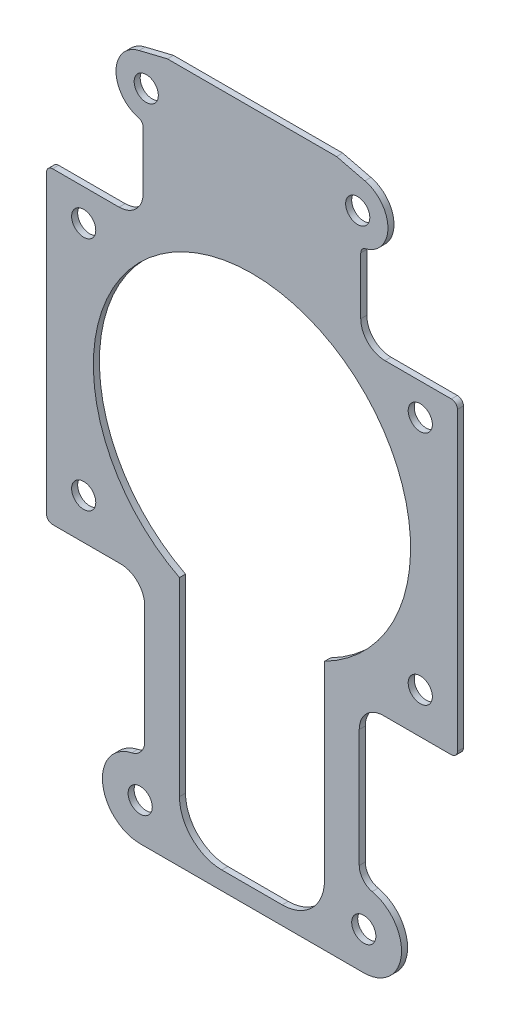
ISO-10303-21;
HEADER;
FILE_DESCRIPTION(('STEP AP214'),'2;1');
FILE_NAME('part.step','',(''),(''),'','','');
FILE_SCHEMA(('AUTOMOTIVE_DESIGN { 1 0 10303 214 1 1 1 1 }'));
ENDSEC;
DATA;
#1=APPLICATION_CONTEXT('core data for automotive mechanical design processes');
#2=APPLICATION_PROTOCOL_DEFINITION('international standard','automotive_design',2000,#1);
#3=PRODUCT_CONTEXT('',#1,'mechanical');
#4=PRODUCT('Part','Part','',(#3));
#5=PRODUCT_RELATED_PRODUCT_CATEGORY('part','',(#4));
#6=PRODUCT_DEFINITION_FORMATION('','',#4);
#7=PRODUCT_DEFINITION_CONTEXT('part definition',#1,'design');
#8=PRODUCT_DEFINITION('design','',#6,#7);
#9=PRODUCT_DEFINITION_SHAPE('','',#8);
#10=(LENGTH_UNIT() NAMED_UNIT(*) SI_UNIT(.MILLI.,.METRE.));
#11=(NAMED_UNIT(*) PLANE_ANGLE_UNIT() SI_UNIT($,.RADIAN.));
#12=(NAMED_UNIT(*) SI_UNIT($,.STERADIAN.) SOLID_ANGLE_UNIT());
#13=UNCERTAINTY_MEASURE_WITH_UNIT(LENGTH_MEASURE(1.E-05),#10,'distance_accuracy_value','');
#14=(GEOMETRIC_REPRESENTATION_CONTEXT(3) GLOBAL_UNCERTAINTY_ASSIGNED_CONTEXT((#13)) GLOBAL_UNIT_ASSIGNED_CONTEXT((#10,
#11,#12)) REPRESENTATION_CONTEXT('',''));
#15=CARTESIAN_POINT('',(0.,0.,0.));
#16=DIRECTION('',(0.,0.,1.));
#17=DIRECTION('',(1.,0.,0.));
#18=AXIS2_PLACEMENT_3D('',#15,#16,#17);
#19=CARTESIAN_POINT('',(-17.5,108.,1.));
#20=DIRECTION('',(0.,0.,1.));
#21=DIRECTION('',(1.,0.,0.));
#22=AXIS2_PLACEMENT_3D('',#19,#20,#21);
#23=PLANE('',#22);
#24=CARTESIAN_POINT('',(-17.5,108.,1.));
#25=DIRECTION('',(0.,0.,1.));
#26=DIRECTION('',(1.,0.,0.));
#27=AXIS2_PLACEMENT_3D('',#24,#25,#26);
#28=CIRCLE('',#27,2.);
#29=CARTESIAN_POINT('',(-15.5,108.,1.));
#30=VERTEX_POINT('',#29);
#31=EDGE_CURVE('E1080',#30,#30,#28,.T.);
#32=ORIENTED_EDGE('',*,*,#31,.F.);
#33=EDGE_LOOP('',(#32));
#34=FACE_BOUND('',#33,.T.);
#35=CARTESIAN_POINT('',(-27.8511695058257,83.5015988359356,1.));
#36=DIRECTION('',(0.,0.,1.));
#37=DIRECTION('',(1.,0.,0.));
#38=AXIS2_PLACEMENT_3D('',#35,#36,#37);
#39=CIRCLE('',#38,2.);
#40=CARTESIAN_POINT('',(-25.8511695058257,83.5015988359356,1.));
#41=VERTEX_POINT('',#40);
#42=EDGE_CURVE('E1092',#41,#41,#39,.T.);
#43=ORIENTED_EDGE('',*,*,#42,.F.);
#44=EDGE_LOOP('',(#43));
#45=FACE_BOUND('',#44,.T.);
#46=CARTESIAN_POINT('',(-27.8511695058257,44.4984011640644,1.));
#47=DIRECTION('',(0.,0.,1.));
#48=DIRECTION('',(1.,0.,0.));
#49=AXIS2_PLACEMENT_3D('',#46,#47,#48);
#50=CIRCLE('',#49,2.);
#51=CARTESIAN_POINT('',(-25.8511695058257,44.4984011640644,1.));
#52=VERTEX_POINT('',#51);
#53=EDGE_CURVE('E1104',#52,#52,#50,.T.);
#54=ORIENTED_EDGE('',*,*,#53,.F.);
#55=EDGE_LOOP('',(#54));
#56=FACE_BOUND('',#55,.T.);
#57=CARTESIAN_POINT('',(-18.5,5.49999999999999,1.));
#58=DIRECTION('',(0.,0.,1.));
#59=DIRECTION('',(1.,0.,0.));
#60=AXIS2_PLACEMENT_3D('',#57,#58,#59);
#61=CIRCLE('',#60,2.);
#62=CARTESIAN_POINT('',(-16.5,5.49999999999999,1.));
#63=VERTEX_POINT('',#62);
#64=EDGE_CURVE('E285',#63,#63,#61,.T.);
#65=ORIENTED_EDGE('',*,*,#64,.F.);
#66=EDGE_LOOP('',(#65));
#67=FACE_BOUND('',#66,.T.);
#68=CARTESIAN_POINT('',(-17.5,108.,1.));
#69=DIRECTION('',(0.,0.,1.));
#70=DIRECTION('',(1.,0.,0.));
#71=AXIS2_PLACEMENT_3D('',#68,#69,#70);
#72=CIRCLE('',#71,4.99999999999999);
#73=CARTESIAN_POINT('',(-18.6845546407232,112.857656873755,1.));
#74=VERTEX_POINT('',#73);
#75=CARTESIAN_POINT('',(-18.7500000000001,103.158770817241,1.));
#76=VERTEX_POINT('',#75);
#77=EDGE_CURVE('E378',#74,#76,#72,.T.);
#78=ORIENTED_EDGE('',*,*,#77,.T.);
#79=CARTESIAN_POINT('',(-19.0000000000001,102.190524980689,1.));
#80=DIRECTION('',(0.,0.,-1.));
#81=DIRECTION('',(1.,0.,0.));
#82=AXIS2_PLACEMENT_3D('',#79,#80,#81);
#83=CIRCLE('',#82,1.00000000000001);
#84=CARTESIAN_POINT('',(-18.,102.190524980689,1.));
#85=VERTEX_POINT('',#84);
#86=EDGE_CURVE('E381',#76,#85,#83,.T.);
#87=ORIENTED_EDGE('',*,*,#86,.T.);
#88=DIRECTION('',(0.,-1.,0.));
#89=VECTOR('',#88,1.);
#90=CARTESIAN_POINT('',(-18.,102.190524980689,1.));
#91=LINE('',#90,#89);
#92=CARTESIAN_POINT('',(-18.,92.75,1.));
#93=VERTEX_POINT('',#92);
#94=EDGE_CURVE('E383',#85,#93,#91,.T.);
#95=ORIENTED_EDGE('',*,*,#94,.T.);
#96=CARTESIAN_POINT('',(-22.,92.75,1.));
#97=DIRECTION('',(0.,0.,-1.));
#98=DIRECTION('',(1.,0.,0.));
#99=AXIS2_PLACEMENT_3D('',#96,#97,#98);
#100=CIRCLE('',#99,4.00000000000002);
#101=CARTESIAN_POINT('',(-22.,88.75,1.));
#102=VERTEX_POINT('',#101);
#103=EDGE_CURVE('E385',#93,#102,#100,.T.);
#104=ORIENTED_EDGE('',*,*,#103,.T.);
#105=DIRECTION('',(-1.,0.,0.));
#106=VECTOR('',#105,1.);
#107=CARTESIAN_POINT('',(-22.,88.75,1.));
#108=LINE('',#107,#106);
#109=CARTESIAN_POINT('',(-33.,88.75,1.));
#110=VERTEX_POINT('',#109);
#111=EDGE_CURVE('E387',#102,#110,#108,.T.);
#112=ORIENTED_EDGE('',*,*,#111,.T.);
#113=CARTESIAN_POINT('',(-33.,87.75,1.));
#114=DIRECTION('',(0.,0.,1.));
#115=DIRECTION('',(1.,0.,0.));
#116=AXIS2_PLACEMENT_3D('',#113,#114,#115);
#117=CIRCLE('',#116,1.);
#118=CARTESIAN_POINT('',(-34.,87.75,1.));
#119=VERTEX_POINT('',#118);
#120=EDGE_CURVE('E389',#110,#119,#117,.T.);
#121=ORIENTED_EDGE('',*,*,#120,.T.);
#122=DIRECTION('',(0.,-1.,0.));
#123=VECTOR('',#122,1.);
#124=CARTESIAN_POINT('',(-34.,87.75,1.));
#125=LINE('',#124,#123);
#126=CARTESIAN_POINT('',(-34.,38.75,1.));
#127=VERTEX_POINT('',#126);
#128=EDGE_CURVE('E391',#119,#127,#125,.T.);
#129=ORIENTED_EDGE('',*,*,#128,.T.);
#130=CARTESIAN_POINT('',(-33.,38.75,1.));
#131=DIRECTION('',(0.,0.,1.));
#132=DIRECTION('',(1.,0.,0.));
#133=AXIS2_PLACEMENT_3D('',#130,#131,#132);
#134=CIRCLE('',#133,0.999999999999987);
#135=CARTESIAN_POINT('',(-33.,37.75,1.));
#136=VERTEX_POINT('',#135);
#137=EDGE_CURVE('E393',#127,#136,#134,.T.);
#138=ORIENTED_EDGE('',*,*,#137,.T.);
#139=DIRECTION('',(1.,0.,0.));
#140=VECTOR('',#139,1.);
#141=CARTESIAN_POINT('',(-33.,37.75,1.));
#142=LINE('',#141,#140);
#143=CARTESIAN_POINT('',(-21.75,37.75,1.));
#144=VERTEX_POINT('',#143);
#145=EDGE_CURVE('E395',#136,#144,#142,.T.);
#146=ORIENTED_EDGE('',*,*,#145,.T.);
#147=CARTESIAN_POINT('',(-21.75,33.75,1.));
#148=DIRECTION('',(0.,0.,-1.));
#149=DIRECTION('',(1.,0.,0.));
#150=AXIS2_PLACEMENT_3D('',#147,#148,#149);
#151=CIRCLE('',#150,4.);
#152=CARTESIAN_POINT('',(-17.75,33.75,1.));
#153=VERTEX_POINT('',#152);
#154=EDGE_CURVE('E397',#144,#153,#151,.T.);
#155=ORIENTED_EDGE('',*,*,#154,.T.);
#156=DIRECTION('',(0.,-1.,0.));
#157=VECTOR('',#156,1.);
#158=CARTESIAN_POINT('',(-17.75,33.75,1.));
#159=LINE('',#158,#157);
#160=CARTESIAN_POINT('',(-17.75,14.2749643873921,1.));
#161=VERTEX_POINT('',#160);
#162=EDGE_CURVE('E399',#153,#161,#159,.T.);
#163=ORIENTED_EDGE('',*,*,#162,.T.);
#164=CARTESIAN_POINT('',(-20.5,14.2749643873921,1.));
#165=DIRECTION('',(0.,0.,-1.));
#166=DIRECTION('',(1.,0.,0.));
#167=AXIS2_PLACEMENT_3D('',#164,#165,#166);
#168=CIRCLE('',#167,2.75);
#169=CARTESIAN_POINT('',(-19.8888888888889,11.5937252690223,1.));
#170=VERTEX_POINT('',#169);
#171=EDGE_CURVE('E401',#161,#170,#168,.T.);
#172=ORIENTED_EDGE('',*,*,#171,.T.);
#173=CARTESIAN_POINT('',(-18.5,5.49999999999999,1.));
#174=DIRECTION('',(0.,0.,1.));
#175=DIRECTION('',(1.,0.,0.));
#176=AXIS2_PLACEMENT_3D('',#173,#174,#175);
#177=CIRCLE('',#176,6.25);
#178=CARTESIAN_POINT('',(-18.5,-0.750000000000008,1.));
#179=VERTEX_POINT('',#178);
#180=EDGE_CURVE('E403',#170,#179,#177,.T.);
#181=ORIENTED_EDGE('',*,*,#180,.T.);
#182=DIRECTION('',(1.,0.,0.));
#183=VECTOR('',#182,1.);
#184=CARTESIAN_POINT('',(-18.5,-0.750000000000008,1.));
#185=LINE('',#184,#183);
#186=CARTESIAN_POINT('',(18.5,-0.75,1.));
#187=VERTEX_POINT('',#186);
#188=EDGE_CURVE('E405',#179,#187,#185,.T.);
#189=ORIENTED_EDGE('',*,*,#188,.T.);
#190=CARTESIAN_POINT('',(18.5,5.5,1.));
#191=DIRECTION('',(0.,0.,1.));
#192=DIRECTION('',(1.,0.,0.));
#193=AXIS2_PLACEMENT_3D('',#190,#191,#192);
#194=CIRCLE('',#193,6.25);
#195=CARTESIAN_POINT('',(19.8888888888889,11.5937252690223,1.));
#196=VERTEX_POINT('',#195);
#197=EDGE_CURVE('E407',#187,#196,#194,.T.);
#198=ORIENTED_EDGE('',*,*,#197,.T.);
#199=CARTESIAN_POINT('',(20.5,14.2749643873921,1.));
#200=DIRECTION('',(0.,0.,-1.));
#201=DIRECTION('',(1.,0.,0.));
#202=AXIS2_PLACEMENT_3D('',#199,#200,#201);
#203=CIRCLE('',#202,2.75);
#204=CARTESIAN_POINT('',(17.75,14.2749643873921,1.));
#205=VERTEX_POINT('',#204);
#206=EDGE_CURVE('E409',#196,#205,#203,.T.);
#207=ORIENTED_EDGE('',*,*,#206,.T.);
#208=DIRECTION('',(0.,1.,0.));
#209=VECTOR('',#208,1.);
#210=CARTESIAN_POINT('',(17.75,14.2749643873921,1.));
#211=LINE('',#210,#209);
#212=CARTESIAN_POINT('',(17.75,33.75,1.));
#213=VERTEX_POINT('',#212);
#214=EDGE_CURVE('E411',#205,#213,#211,.T.);
#215=ORIENTED_EDGE('',*,*,#214,.T.);
#216=CARTESIAN_POINT('',(21.75,33.75,1.));
#217=DIRECTION('',(0.,0.,-1.));
#218=DIRECTION('',(1.,0.,0.));
#219=AXIS2_PLACEMENT_3D('',#216,#217,#218);
#220=CIRCLE('',#219,4.);
#221=CARTESIAN_POINT('',(21.75,37.75,1.));
#222=VERTEX_POINT('',#221);
#223=EDGE_CURVE('E413',#213,#222,#220,.T.);
#224=ORIENTED_EDGE('',*,*,#223,.T.);
#225=DIRECTION('',(1.,0.,0.));
#226=VECTOR('',#225,1.);
#227=CARTESIAN_POINT('',(21.75,37.75,1.));
#228=LINE('',#227,#226);
#229=CARTESIAN_POINT('',(33.,37.75,1.));
#230=VERTEX_POINT('',#229);
#231=EDGE_CURVE('E415',#222,#230,#228,.T.);
#232=ORIENTED_EDGE('',*,*,#231,.T.);
#233=CARTESIAN_POINT('',(33.,38.75,1.));
#234=DIRECTION('',(0.,0.,1.));
#235=DIRECTION('',(1.,0.,0.));
#236=AXIS2_PLACEMENT_3D('',#233,#234,#235);
#237=CIRCLE('',#236,1.);
#238=CARTESIAN_POINT('',(34.,38.75,1.));
#239=VERTEX_POINT('',#238);
#240=EDGE_CURVE('E417',#230,#239,#237,.T.);
#241=ORIENTED_EDGE('',*,*,#240,.T.);
#242=DIRECTION('',(0.,1.,0.));
#243=VECTOR('',#242,1.);
#244=CARTESIAN_POINT('',(34.,38.75,1.));
#245=LINE('',#244,#243);
#246=CARTESIAN_POINT('',(34.,87.75,1.));
#247=VERTEX_POINT('',#246);
#248=EDGE_CURVE('E419',#239,#247,#245,.T.);
#249=ORIENTED_EDGE('',*,*,#248,.T.);
#250=CARTESIAN_POINT('',(33.,87.75,1.));
#251=DIRECTION('',(0.,0.,1.));
#252=DIRECTION('',(1.,0.,0.));
#253=AXIS2_PLACEMENT_3D('',#250,#251,#252);
#254=CIRCLE('',#253,0.999999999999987);
#255=CARTESIAN_POINT('',(33.,88.75,1.));
#256=VERTEX_POINT('',#255);
#257=EDGE_CURVE('E421',#247,#256,#254,.T.);
#258=ORIENTED_EDGE('',*,*,#257,.T.);
#259=DIRECTION('',(-1.,0.,0.));
#260=VECTOR('',#259,1.);
#261=CARTESIAN_POINT('',(33.,88.75,1.));
#262=LINE('',#261,#260);
#263=CARTESIAN_POINT('',(22.,88.75,1.));
#264=VERTEX_POINT('',#263);
#265=EDGE_CURVE('E423',#256,#264,#262,.T.);
#266=ORIENTED_EDGE('',*,*,#265,.T.);
#267=CARTESIAN_POINT('',(22.,92.75,1.));
#268=DIRECTION('',(0.,0.,-1.));
#269=DIRECTION('',(1.,0.,0.));
#270=AXIS2_PLACEMENT_3D('',#267,#268,#269);
#271=CIRCLE('',#270,4.);
#272=CARTESIAN_POINT('',(17.9999999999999,92.75,1.));
#273=VERTEX_POINT('',#272);
#274=EDGE_CURVE('E425',#264,#273,#271,.T.);
#275=ORIENTED_EDGE('',*,*,#274,.T.);
#276=DIRECTION('',(0.,1.,0.));
#277=VECTOR('',#276,1.);
#278=CARTESIAN_POINT('',(17.9999999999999,92.75,1.));
#279=LINE('',#278,#277);
#280=CARTESIAN_POINT('',(17.9999999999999,102.190524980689,1.));
#281=VERTEX_POINT('',#280);
#282=EDGE_CURVE('E427',#273,#281,#279,.T.);
#283=ORIENTED_EDGE('',*,*,#282,.T.);
#284=CARTESIAN_POINT('',(18.9999999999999,102.190524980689,1.));
#285=DIRECTION('',(0.,0.,-1.));
#286=DIRECTION('',(1.,0.,0.));
#287=AXIS2_PLACEMENT_3D('',#284,#285,#286);
#288=CIRCLE('',#287,1.);
#289=CARTESIAN_POINT('',(18.7499999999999,103.158770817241,1.));
#290=VERTEX_POINT('',#289);
#291=EDGE_CURVE('E429',#281,#290,#288,.T.);
#292=ORIENTED_EDGE('',*,*,#291,.T.);
#293=CARTESIAN_POINT('',(17.5,108.,1.));
#294=DIRECTION('',(0.,0.,1.));
#295=DIRECTION('',(1.,0.,0.));
#296=AXIS2_PLACEMENT_3D('',#293,#294,#295);
#297=CIRCLE('',#296,4.99999999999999);
#298=CARTESIAN_POINT('',(18.6845546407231,112.857656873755,1.));
#299=VERTEX_POINT('',#298);
#300=EDGE_CURVE('E431',#290,#299,#297,.T.);
#301=ORIENTED_EDGE('',*,*,#300,.T.);
#302=DIRECTION('',(-0.971531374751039,0.236910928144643,0.));
#303=VECTOR('',#302,1.);
#304=CARTESIAN_POINT('',(18.6845546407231,112.857656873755,1.));
#305=LINE('',#304,#303);
#306=CARTESIAN_POINT('',(14.,114.,1.));
#307=VERTEX_POINT('',#306);
#308=EDGE_CURVE('E433',#299,#307,#305,.T.);
#309=ORIENTED_EDGE('',*,*,#308,.T.);
#310=DIRECTION('',(-1.,0.,0.));
#311=VECTOR('',#310,1.);
#312=CARTESIAN_POINT('',(14.,114.,1.));
#313=LINE('',#312,#311);
#314=CARTESIAN_POINT('',(-14.,114.,1.));
#315=VERTEX_POINT('',#314);
#316=EDGE_CURVE('E435',#307,#315,#313,.T.);
#317=ORIENTED_EDGE('',*,*,#316,.T.);
#318=DIRECTION('',(-0.971531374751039,-0.236910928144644,0.));
#319=VECTOR('',#318,1.);
#320=CARTESIAN_POINT('',(-14.,114.,1.));
#321=LINE('',#320,#319);
#322=EDGE_CURVE('E437',#315,#74,#321,.T.);
#323=ORIENTED_EDGE('',*,*,#322,.T.);
#324=EDGE_LOOP('',(#78,#87,#95,#104,#112,#121,#129,#138,#146,#155,#163,#172,#181,#189,#198,#207,
#215,#224,#232,#241,#249,#258,#266,#275,#283,#292,#301,#309,#317,#323));
#325=FACE_BOUND('',#324,.T.);
#326=DIRECTION('',(0.,-1.,0.));
#327=VECTOR('',#326,1.);
#328=CARTESIAN_POINT('',(-12.,40.6534263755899,1.));
#329=LINE('',#328,#327);
#330=CARTESIAN_POINT('',(-12.,40.6534263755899,1.));
#331=VERTEX_POINT('',#330);
#332=CARTESIAN_POINT('',(-12.,9.25000000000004,1.));
#333=VERTEX_POINT('',#332);
#334=EDGE_CURVE('E300',#331,#333,#329,.T.);
#335=ORIENTED_EDGE('',*,*,#334,.F.);
#336=CARTESIAN_POINT('',(0.,64.,1.));
#337=DIRECTION('',(0.,0.,1.));
#338=DIRECTION('',(1.,0.,0.));
#339=AXIS2_PLACEMENT_3D('',#336,#337,#338);
#340=CIRCLE('',#339,26.25);
#341=CARTESIAN_POINT('',(12.,40.6534263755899,1.));
#342=VERTEX_POINT('',#341);
#343=EDGE_CURVE('E277',#342,#331,#340,.T.);
#344=ORIENTED_EDGE('',*,*,#343,.F.);
#345=DIRECTION('',(0.,1.,0.));
#346=VECTOR('',#345,1.);
#347=CARTESIAN_POINT('',(12.,9.25000000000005,1.));
#348=LINE('',#347,#346);
#349=CARTESIAN_POINT('',(12.,9.25000000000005,1.));
#350=VERTEX_POINT('',#349);
#351=EDGE_CURVE('E308',#350,#342,#348,.T.);
#352=ORIENTED_EDGE('',*,*,#351,.F.);
#353=CARTESIAN_POINT('',(5.,9.25,1.));
#354=DIRECTION('',(0.,0.,1.));
#355=DIRECTION('',(1.,0.,0.));
#356=AXIS2_PLACEMENT_3D('',#353,#354,#355);
#357=CIRCLE('',#356,7.);
#358=CARTESIAN_POINT('',(4.99999999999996,2.25,1.));
#359=VERTEX_POINT('',#358);
#360=EDGE_CURVE('E306',#359,#350,#357,.T.);
#361=ORIENTED_EDGE('',*,*,#360,.F.);
#362=DIRECTION('',(1.,0.,0.));
#363=VECTOR('',#362,1.);
#364=CARTESIAN_POINT('',(-4.99999999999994,2.25,1.));
#365=LINE('',#364,#363);
#366=CARTESIAN_POINT('',(-4.99999999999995,2.25,1.));
#367=VERTEX_POINT('',#366);
#368=EDGE_CURVE('E304',#367,#359,#365,.T.);
#369=ORIENTED_EDGE('',*,*,#368,.F.);
#370=CARTESIAN_POINT('',(-4.99999999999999,9.25,1.));
#371=DIRECTION('',(0.,0.,1.));
#372=DIRECTION('',(1.,0.,0.));
#373=AXIS2_PLACEMENT_3D('',#370,#371,#372);
#374=CIRCLE('',#373,7.);
#375=EDGE_CURVE('E302',#333,#367,#374,.T.);
#376=ORIENTED_EDGE('',*,*,#375,.F.);
#377=EDGE_LOOP('',(#335,#344,#352,#361,#369,#376));
#378=FACE_BOUND('',#377,.T.);
#379=CARTESIAN_POINT('',(18.5,5.5,1.));
#380=DIRECTION('',(0.,0.,1.));
#381=DIRECTION('',(1.,0.,0.));
#382=AXIS2_PLACEMENT_3D('',#379,#380,#381);
#383=CIRCLE('',#382,2.);
#384=CARTESIAN_POINT('',(20.5,5.5,1.));
#385=VERTEX_POINT('',#384);
#386=EDGE_CURVE('E1110',#385,#385,#383,.T.);
#387=ORIENTED_EDGE('',*,*,#386,.F.);
#388=EDGE_LOOP('',(#387));
#389=FACE_BOUND('',#388,.T.);
#390=CARTESIAN_POINT('',(27.8511695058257,44.4984011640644,1.));
#391=DIRECTION('',(0.,0.,1.));
#392=DIRECTION('',(1.,0.,0.));
#393=AXIS2_PLACEMENT_3D('',#390,#391,#392);
#394=CIRCLE('',#393,2.);
#395=CARTESIAN_POINT('',(29.8511695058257,44.4984011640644,1.));
#396=VERTEX_POINT('',#395);
#397=EDGE_CURVE('E1098',#396,#396,#394,.T.);
#398=ORIENTED_EDGE('',*,*,#397,.F.);
#399=EDGE_LOOP('',(#398));
#400=FACE_BOUND('',#399,.T.);
#401=CARTESIAN_POINT('',(27.8511695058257,83.5015988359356,1.));
#402=DIRECTION('',(0.,0.,1.));
#403=DIRECTION('',(1.,0.,0.));
#404=AXIS2_PLACEMENT_3D('',#401,#402,#403);
#405=CIRCLE('',#404,2.);
#406=CARTESIAN_POINT('',(29.8511695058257,83.5015988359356,1.));
#407=VERTEX_POINT('',#406);
#408=EDGE_CURVE('E1086',#407,#407,#405,.T.);
#409=ORIENTED_EDGE('',*,*,#408,.F.);
#410=EDGE_LOOP('',(#409));
#411=FACE_BOUND('',#410,.T.);
#412=CARTESIAN_POINT('',(17.5,108.,1.));
#413=DIRECTION('',(0.,0.,1.));
#414=DIRECTION('',(1.,0.,0.));
#415=AXIS2_PLACEMENT_3D('',#412,#413,#414);
#416=CIRCLE('',#415,2.);
#417=CARTESIAN_POINT('',(19.5,108.,1.));
#418=VERTEX_POINT('',#417);
#419=EDGE_CURVE('E1069',#418,#418,#416,.T.);
#420=ORIENTED_EDGE('',*,*,#419,.F.);
#421=EDGE_LOOP('',(#420));
#422=FACE_BOUND('',#421,.T.);
#423=ADVANCED_FACE('F29',(#34,#45,#56,#67,#325,#378,#389,#400,#411,#422),#23,.T.);
#424=CARTESIAN_POINT('',(-17.5,108.,0.));
#425=DIRECTION('',(0.,0.,1.));
#426=DIRECTION('',(1.,0.,0.));
#427=AXIS2_PLACEMENT_3D('',#424,#425,#426);
#428=PLANE('',#427);
#429=CARTESIAN_POINT('',(-17.5,108.,0.));
#430=DIRECTION('',(0.,0.,1.));
#431=DIRECTION('',(1.,0.,0.));
#432=AXIS2_PLACEMENT_3D('',#429,#430,#431);
#433=CIRCLE('',#432,2.);
#434=CARTESIAN_POINT('',(-15.5,108.,0.));
#435=VERTEX_POINT('',#434);
#436=EDGE_CURVE('E1075',#435,#435,#433,.T.);
#437=ORIENTED_EDGE('',*,*,#436,.T.);
#438=EDGE_LOOP('',(#437));
#439=FACE_BOUND('',#438,.T.);
#440=CARTESIAN_POINT('',(-27.8511695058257,83.5015988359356,0.));
#441=DIRECTION('',(0.,0.,1.));
#442=DIRECTION('',(1.,0.,0.));
#443=AXIS2_PLACEMENT_3D('',#440,#441,#442);
#444=CIRCLE('',#443,2.);
#445=CARTESIAN_POINT('',(-25.8511695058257,83.5015988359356,0.));
#446=VERTEX_POINT('',#445);
#447=EDGE_CURVE('E1089',#446,#446,#444,.T.);
#448=ORIENTED_EDGE('',*,*,#447,.T.);
#449=EDGE_LOOP('',(#448));
#450=FACE_BOUND('',#449,.T.);
#451=CARTESIAN_POINT('',(-27.8511695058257,44.4984011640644,0.));
#452=DIRECTION('',(0.,0.,1.));
#453=DIRECTION('',(1.,0.,0.));
#454=AXIS2_PLACEMENT_3D('',#451,#452,#453);
#455=CIRCLE('',#454,2.);
#456=CARTESIAN_POINT('',(-25.8511695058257,44.4984011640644,0.));
#457=VERTEX_POINT('',#456);
#458=EDGE_CURVE('E1101',#457,#457,#455,.T.);
#459=ORIENTED_EDGE('',*,*,#458,.T.);
#460=EDGE_LOOP('',(#459));
#461=FACE_BOUND('',#460,.T.);
#462=CARTESIAN_POINT('',(-18.5,5.49999999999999,0.));
#463=DIRECTION('',(0.,0.,1.));
#464=DIRECTION('',(1.,0.,0.));
#465=AXIS2_PLACEMENT_3D('',#462,#463,#464);
#466=CIRCLE('',#465,2.);
#467=CARTESIAN_POINT('',(-16.5,5.49999999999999,0.));
#468=VERTEX_POINT('',#467);
#469=EDGE_CURVE('E288',#468,#468,#466,.T.);
#470=ORIENTED_EDGE('',*,*,#469,.T.);
#471=EDGE_LOOP('',(#470));
#472=FACE_BOUND('',#471,.T.);
#473=CARTESIAN_POINT('',(-17.5,108.,0.));
#474=DIRECTION('',(0.,0.,1.));
#475=DIRECTION('',(1.,0.,0.));
#476=AXIS2_PLACEMENT_3D('',#473,#474,#475);
#477=CIRCLE('',#476,4.99999999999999);
#478=CARTESIAN_POINT('',(-18.6845546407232,112.857656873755,0.));
#479=VERTEX_POINT('',#478);
#480=CARTESIAN_POINT('',(-18.7500000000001,103.158770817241,0.));
#481=VERTEX_POINT('',#480);
#482=EDGE_CURVE('E278',#479,#481,#477,.T.);
#483=ORIENTED_EDGE('',*,*,#482,.F.);
#484=DIRECTION('',(-0.971531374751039,-0.236910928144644,0.));
#485=VECTOR('',#484,1.);
#486=CARTESIAN_POINT('',(-14.,114.,0.));
#487=LINE('',#486,#485);
#488=CARTESIAN_POINT('',(-14.,114.,0.));
#489=VERTEX_POINT('',#488);
#490=EDGE_CURVE('E376',#489,#479,#487,.T.);
#491=ORIENTED_EDGE('',*,*,#490,.F.);
#492=DIRECTION('',(-1.,0.,0.));
#493=VECTOR('',#492,1.);
#494=CARTESIAN_POINT('',(14.,114.,0.));
#495=LINE('',#494,#493);
#496=CARTESIAN_POINT('',(14.,114.,0.));
#497=VERTEX_POINT('',#496);
#498=EDGE_CURVE('E374',#497,#489,#495,.T.);
#499=ORIENTED_EDGE('',*,*,#498,.F.);
#500=DIRECTION('',(-0.971531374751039,0.236910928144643,0.));
#501=VECTOR('',#500,1.);
#502=CARTESIAN_POINT('',(18.6845546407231,112.857656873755,0.));
#503=LINE('',#502,#501);
#504=CARTESIAN_POINT('',(18.6845546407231,112.857656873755,0.));
#505=VERTEX_POINT('',#504);
#506=EDGE_CURVE('E372',#505,#497,#503,.T.);
#507=ORIENTED_EDGE('',*,*,#506,.F.);
#508=CARTESIAN_POINT('',(17.5,108.,0.));
#509=DIRECTION('',(0.,0.,1.));
#510=DIRECTION('',(1.,0.,0.));
#511=AXIS2_PLACEMENT_3D('',#508,#509,#510);
#512=CIRCLE('',#511,4.99999999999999);
#513=CARTESIAN_POINT('',(18.7499999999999,103.158770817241,0.));
#514=VERTEX_POINT('',#513);
#515=EDGE_CURVE('E370',#514,#505,#512,.T.);
#516=ORIENTED_EDGE('',*,*,#515,.F.);
#517=CARTESIAN_POINT('',(18.9999999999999,102.190524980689,0.));
#518=DIRECTION('',(0.,0.,-1.));
#519=DIRECTION('',(1.,0.,0.));
#520=AXIS2_PLACEMENT_3D('',#517,#518,#519);
#521=CIRCLE('',#520,1.);
#522=CARTESIAN_POINT('',(17.9999999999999,102.190524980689,0.));
#523=VERTEX_POINT('',#522);
#524=EDGE_CURVE('E368',#523,#514,#521,.T.);
#525=ORIENTED_EDGE('',*,*,#524,.F.);
#526=DIRECTION('',(0.,1.,0.));
#527=VECTOR('',#526,1.);
#528=CARTESIAN_POINT('',(17.9999999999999,92.75,0.));
#529=LINE('',#528,#527);
#530=CARTESIAN_POINT('',(17.9999999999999,92.75,0.));
#531=VERTEX_POINT('',#530);
#532=EDGE_CURVE('E366',#531,#523,#529,.T.);
#533=ORIENTED_EDGE('',*,*,#532,.F.);
#534=CARTESIAN_POINT('',(22.,92.75,0.));
#535=DIRECTION('',(0.,0.,-1.));
#536=DIRECTION('',(1.,0.,0.));
#537=AXIS2_PLACEMENT_3D('',#534,#535,#536);
#538=CIRCLE('',#537,4.);
#539=CARTESIAN_POINT('',(22.,88.75,0.));
#540=VERTEX_POINT('',#539);
#541=EDGE_CURVE('E364',#540,#531,#538,.T.);
#542=ORIENTED_EDGE('',*,*,#541,.F.);
#543=DIRECTION('',(-1.,0.,0.));
#544=VECTOR('',#543,1.);
#545=CARTESIAN_POINT('',(33.,88.75,0.));
#546=LINE('',#545,#544);
#547=CARTESIAN_POINT('',(33.,88.75,0.));
#548=VERTEX_POINT('',#547);
#549=EDGE_CURVE('E362',#548,#540,#546,.T.);
#550=ORIENTED_EDGE('',*,*,#549,.F.);
#551=CARTESIAN_POINT('',(33.,87.75,0.));
#552=DIRECTION('',(0.,0.,1.));
#553=DIRECTION('',(1.,0.,0.));
#554=AXIS2_PLACEMENT_3D('',#551,#552,#553);
#555=CIRCLE('',#554,0.999999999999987);
#556=CARTESIAN_POINT('',(34.,87.75,0.));
#557=VERTEX_POINT('',#556);
#558=EDGE_CURVE('E360',#557,#548,#555,.T.);
#559=ORIENTED_EDGE('',*,*,#558,.F.);
#560=DIRECTION('',(0.,1.,0.));
#561=VECTOR('',#560,1.);
#562=CARTESIAN_POINT('',(34.,38.75,0.));
#563=LINE('',#562,#561);
#564=CARTESIAN_POINT('',(34.,38.75,0.));
#565=VERTEX_POINT('',#564);
#566=EDGE_CURVE('E358',#565,#557,#563,.T.);
#567=ORIENTED_EDGE('',*,*,#566,.F.);
#568=CARTESIAN_POINT('',(33.,38.75,0.));
#569=DIRECTION('',(0.,0.,1.));
#570=DIRECTION('',(1.,0.,0.));
#571=AXIS2_PLACEMENT_3D('',#568,#569,#570);
#572=CIRCLE('',#571,1.);
#573=CARTESIAN_POINT('',(33.,37.75,0.));
#574=VERTEX_POINT('',#573);
#575=EDGE_CURVE('E356',#574,#565,#572,.T.);
#576=ORIENTED_EDGE('',*,*,#575,.F.);
#577=DIRECTION('',(1.,0.,0.));
#578=VECTOR('',#577,1.);
#579=CARTESIAN_POINT('',(21.75,37.75,0.));
#580=LINE('',#579,#578);
#581=CARTESIAN_POINT('',(21.75,37.75,0.));
#582=VERTEX_POINT('',#581);
#583=EDGE_CURVE('E354',#582,#574,#580,.T.);
#584=ORIENTED_EDGE('',*,*,#583,.F.);
#585=CARTESIAN_POINT('',(21.75,33.75,0.));
#586=DIRECTION('',(0.,0.,-1.));
#587=DIRECTION('',(1.,0.,0.));
#588=AXIS2_PLACEMENT_3D('',#585,#586,#587);
#589=CIRCLE('',#588,4.);
#590=CARTESIAN_POINT('',(17.75,33.75,0.));
#591=VERTEX_POINT('',#590);
#592=EDGE_CURVE('E352',#591,#582,#589,.T.);
#593=ORIENTED_EDGE('',*,*,#592,.F.);
#594=DIRECTION('',(0.,1.,0.));
#595=VECTOR('',#594,1.);
#596=CARTESIAN_POINT('',(17.75,14.2749643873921,0.));
#597=LINE('',#596,#595);
#598=CARTESIAN_POINT('',(17.75,14.2749643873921,0.));
#599=VERTEX_POINT('',#598);
#600=EDGE_CURVE('E350',#599,#591,#597,.T.);
#601=ORIENTED_EDGE('',*,*,#600,.F.);
#602=CARTESIAN_POINT('',(20.5,14.2749643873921,0.));
#603=DIRECTION('',(0.,0.,-1.));
#604=DIRECTION('',(1.,0.,0.));
#605=AXIS2_PLACEMENT_3D('',#602,#603,#604);
#606=CIRCLE('',#605,2.75);
#607=CARTESIAN_POINT('',(19.8888888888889,11.5937252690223,0.));
#608=VERTEX_POINT('',#607);
#609=EDGE_CURVE('E348',#608,#599,#606,.T.);
#610=ORIENTED_EDGE('',*,*,#609,.F.);
#611=CARTESIAN_POINT('',(18.5,5.5,0.));
#612=DIRECTION('',(0.,0.,1.));
#613=DIRECTION('',(1.,0.,0.));
#614=AXIS2_PLACEMENT_3D('',#611,#612,#613);
#615=CIRCLE('',#614,6.25);
#616=CARTESIAN_POINT('',(18.5,-0.75,0.));
#617=VERTEX_POINT('',#616);
#618=EDGE_CURVE('E346',#617,#608,#615,.T.);
#619=ORIENTED_EDGE('',*,*,#618,.F.);
#620=DIRECTION('',(1.,0.,0.));
#621=VECTOR('',#620,1.);
#622=CARTESIAN_POINT('',(-18.5,-0.750000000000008,0.));
#623=LINE('',#622,#621);
#624=CARTESIAN_POINT('',(-18.5,-0.750000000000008,0.));
#625=VERTEX_POINT('',#624);
#626=EDGE_CURVE('E344',#625,#617,#623,.T.);
#627=ORIENTED_EDGE('',*,*,#626,.F.);
#628=CARTESIAN_POINT('',(-18.5,5.49999999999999,0.));
#629=DIRECTION('',(0.,0.,1.));
#630=DIRECTION('',(1.,0.,0.));
#631=AXIS2_PLACEMENT_3D('',#628,#629,#630);
#632=CIRCLE('',#631,6.25);
#633=CARTESIAN_POINT('',(-19.8888888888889,11.5937252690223,0.));
#634=VERTEX_POINT('',#633);
#635=EDGE_CURVE('E342',#634,#625,#632,.T.);
#636=ORIENTED_EDGE('',*,*,#635,.F.);
#637=CARTESIAN_POINT('',(-20.5,14.2749643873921,0.));
#638=DIRECTION('',(0.,0.,-1.));
#639=DIRECTION('',(1.,0.,0.));
#640=AXIS2_PLACEMENT_3D('',#637,#638,#639);
#641=CIRCLE('',#640,2.75);
#642=CARTESIAN_POINT('',(-17.75,14.2749643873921,0.));
#643=VERTEX_POINT('',#642);
#644=EDGE_CURVE('E340',#643,#634,#641,.T.);
#645=ORIENTED_EDGE('',*,*,#644,.F.);
#646=DIRECTION('',(0.,-1.,0.));
#647=VECTOR('',#646,1.);
#648=CARTESIAN_POINT('',(-17.75,33.75,0.));
#649=LINE('',#648,#647);
#650=CARTESIAN_POINT('',(-17.75,33.75,0.));
#651=VERTEX_POINT('',#650);
#652=EDGE_CURVE('E338',#651,#643,#649,.T.);
#653=ORIENTED_EDGE('',*,*,#652,.F.);
#654=CARTESIAN_POINT('',(-21.75,33.75,0.));
#655=DIRECTION('',(0.,0.,-1.));
#656=DIRECTION('',(1.,0.,0.));
#657=AXIS2_PLACEMENT_3D('',#654,#655,#656);
#658=CIRCLE('',#657,4.);
#659=CARTESIAN_POINT('',(-21.75,37.75,0.));
#660=VERTEX_POINT('',#659);
#661=EDGE_CURVE('E336',#660,#651,#658,.T.);
#662=ORIENTED_EDGE('',*,*,#661,.F.);
#663=DIRECTION('',(1.,0.,0.));
#664=VECTOR('',#663,1.);
#665=CARTESIAN_POINT('',(-33.,37.75,0.));
#666=LINE('',#665,#664);
#667=CARTESIAN_POINT('',(-33.,37.75,0.));
#668=VERTEX_POINT('',#667);
#669=EDGE_CURVE('E334',#668,#660,#666,.T.);
#670=ORIENTED_EDGE('',*,*,#669,.F.);
#671=CARTESIAN_POINT('',(-33.,38.75,0.));
#672=DIRECTION('',(0.,0.,1.));
#673=DIRECTION('',(1.,0.,0.));
#674=AXIS2_PLACEMENT_3D('',#671,#672,#673);
#675=CIRCLE('',#674,0.999999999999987);
#676=CARTESIAN_POINT('',(-34.,38.75,0.));
#677=VERTEX_POINT('',#676);
#678=EDGE_CURVE('E332',#677,#668,#675,.T.);
#679=ORIENTED_EDGE('',*,*,#678,.F.);
#680=DIRECTION('',(0.,-1.,0.));
#681=VECTOR('',#680,1.);
#682=CARTESIAN_POINT('',(-34.,87.75,0.));
#683=LINE('',#682,#681);
#684=CARTESIAN_POINT('',(-34.,87.75,0.));
#685=VERTEX_POINT('',#684);
#686=EDGE_CURVE('E330',#685,#677,#683,.T.);
#687=ORIENTED_EDGE('',*,*,#686,.F.);
#688=CARTESIAN_POINT('',(-33.,87.75,0.));
#689=DIRECTION('',(0.,0.,1.));
#690=DIRECTION('',(1.,0.,0.));
#691=AXIS2_PLACEMENT_3D('',#688,#689,#690);
#692=CIRCLE('',#691,1.);
#693=CARTESIAN_POINT('',(-33.,88.75,0.));
#694=VERTEX_POINT('',#693);
#695=EDGE_CURVE('E328',#694,#685,#692,.T.);
#696=ORIENTED_EDGE('',*,*,#695,.F.);
#697=DIRECTION('',(-1.,0.,0.));
#698=VECTOR('',#697,1.);
#699=CARTESIAN_POINT('',(-22.,88.75,0.));
#700=LINE('',#699,#698);
#701=CARTESIAN_POINT('',(-22.,88.75,0.));
#702=VERTEX_POINT('',#701);
#703=EDGE_CURVE('E326',#702,#694,#700,.T.);
#704=ORIENTED_EDGE('',*,*,#703,.F.);
#705=CARTESIAN_POINT('',(-22.,92.75,0.));
#706=DIRECTION('',(0.,0.,-1.));
#707=DIRECTION('',(1.,0.,0.));
#708=AXIS2_PLACEMENT_3D('',#705,#706,#707);
#709=CIRCLE('',#708,4.00000000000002);
#710=CARTESIAN_POINT('',(-18.,92.75,0.));
#711=VERTEX_POINT('',#710);
#712=EDGE_CURVE('E324',#711,#702,#709,.T.);
#713=ORIENTED_EDGE('',*,*,#712,.F.);
#714=DIRECTION('',(0.,-1.,0.));
#715=VECTOR('',#714,1.);
#716=CARTESIAN_POINT('',(-18.,102.190524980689,0.));
#717=LINE('',#716,#715);
#718=CARTESIAN_POINT('',(-18.,102.190524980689,0.));
#719=VERTEX_POINT('',#718);
#720=EDGE_CURVE('E322',#719,#711,#717,.T.);
#721=ORIENTED_EDGE('',*,*,#720,.F.);
#722=CARTESIAN_POINT('',(-19.0000000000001,102.190524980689,0.));
#723=DIRECTION('',(0.,0.,-1.));
#724=DIRECTION('',(1.,0.,0.));
#725=AXIS2_PLACEMENT_3D('',#722,#723,#724);
#726=CIRCLE('',#725,1.00000000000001);
#727=EDGE_CURVE('E320',#481,#719,#726,.T.);
#728=ORIENTED_EDGE('',*,*,#727,.F.);
#729=EDGE_LOOP('',(#483,#491,#499,#507,#516,#525,#533,#542,#550,#559,#567,#576,#584,#593,#601,
#610,#619,#627,#636,#645,#653,#662,#670,#679,#687,#696,#704,#713,#721,#728));
#730=FACE_BOUND('',#729,.T.);
#731=CARTESIAN_POINT('',(0.,64.,0.));
#732=DIRECTION('',(0.,0.,1.));
#733=DIRECTION('',(1.,0.,0.));
#734=AXIS2_PLACEMENT_3D('',#731,#732,#733);
#735=CIRCLE('',#734,26.25);
#736=CARTESIAN_POINT('',(12.,40.6534263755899,0.));
#737=VERTEX_POINT('',#736);
#738=CARTESIAN_POINT('',(-12.,40.6534263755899,0.));
#739=VERTEX_POINT('',#738);
#740=EDGE_CURVE('E52',#737,#739,#735,.T.);
#741=ORIENTED_EDGE('',*,*,#740,.T.);
#742=DIRECTION('',(0.,-1.,0.));
#743=VECTOR('',#742,1.);
#744=CARTESIAN_POINT('',(-12.,40.6534263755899,0.));
#745=LINE('',#744,#743);
#746=CARTESIAN_POINT('',(-12.,9.25000000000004,0.));
#747=VERTEX_POINT('',#746);
#748=EDGE_CURVE('E264',#739,#747,#745,.T.);
#749=ORIENTED_EDGE('',*,*,#748,.T.);
#750=CARTESIAN_POINT('',(-4.99999999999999,9.25,0.));
#751=DIRECTION('',(0.,0.,1.));
#752=DIRECTION('',(1.,0.,0.));
#753=AXIS2_PLACEMENT_3D('',#750,#751,#752);
#754=CIRCLE('',#753,7.);
#755=CARTESIAN_POINT('',(-4.99999999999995,2.25,0.));
#756=VERTEX_POINT('',#755);
#757=EDGE_CURVE('E273',#747,#756,#754,.T.);
#758=ORIENTED_EDGE('',*,*,#757,.T.);
#759=DIRECTION('',(1.,0.,0.));
#760=VECTOR('',#759,1.);
#761=CARTESIAN_POINT('',(-4.99999999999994,2.25,0.));
#762=LINE('',#761,#760);
#763=CARTESIAN_POINT('',(4.99999999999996,2.25,0.));
#764=VERTEX_POINT('',#763);
#765=EDGE_CURVE('E293',#756,#764,#762,.T.);
#766=ORIENTED_EDGE('',*,*,#765,.T.);
#767=CARTESIAN_POINT('',(5.,9.25,0.));
#768=DIRECTION('',(0.,0.,1.));
#769=DIRECTION('',(1.,0.,0.));
#770=AXIS2_PLACEMENT_3D('',#767,#768,#769);
#771=CIRCLE('',#770,7.);
#772=CARTESIAN_POINT('',(12.,9.25000000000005,0.));
#773=VERTEX_POINT('',#772);
#774=EDGE_CURVE('E296',#764,#773,#771,.T.);
#775=ORIENTED_EDGE('',*,*,#774,.T.);
#776=DIRECTION('',(0.,1.,0.));
#777=VECTOR('',#776,1.);
#778=CARTESIAN_POINT('',(12.,9.25000000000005,0.));
#779=LINE('',#778,#777);
#780=EDGE_CURVE('E284',#773,#737,#779,.T.);
#781=ORIENTED_EDGE('',*,*,#780,.T.);
#782=EDGE_LOOP('',(#741,#749,#758,#766,#775,#781));
#783=FACE_BOUND('',#782,.T.);
#784=CARTESIAN_POINT('',(18.5,5.5,0.));
#785=DIRECTION('',(0.,0.,1.));
#786=DIRECTION('',(1.,0.,0.));
#787=AXIS2_PLACEMENT_3D('',#784,#785,#786);
#788=CIRCLE('',#787,2.);
#789=CARTESIAN_POINT('',(20.5,5.5,0.));
#790=VERTEX_POINT('',#789);
#791=EDGE_CURVE('E1107',#790,#790,#788,.T.);
#792=ORIENTED_EDGE('',*,*,#791,.T.);
#793=EDGE_LOOP('',(#792));
#794=FACE_BOUND('',#793,.T.);
#795=CARTESIAN_POINT('',(27.8511695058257,44.4984011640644,0.));
#796=DIRECTION('',(0.,0.,1.));
#797=DIRECTION('',(1.,0.,0.));
#798=AXIS2_PLACEMENT_3D('',#795,#796,#797);
#799=CIRCLE('',#798,2.);
#800=CARTESIAN_POINT('',(29.8511695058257,44.4984011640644,0.));
#801=VERTEX_POINT('',#800);
#802=EDGE_CURVE('E1095',#801,#801,#799,.T.);
#803=ORIENTED_EDGE('',*,*,#802,.T.);
#804=EDGE_LOOP('',(#803));
#805=FACE_BOUND('',#804,.T.);
#806=CARTESIAN_POINT('',(27.8511695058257,83.5015988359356,0.));
#807=DIRECTION('',(0.,0.,1.));
#808=DIRECTION('',(1.,0.,0.));
#809=AXIS2_PLACEMENT_3D('',#806,#807,#808);
#810=CIRCLE('',#809,2.);
#811=CARTESIAN_POINT('',(29.8511695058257,83.5015988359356,0.));
#812=VERTEX_POINT('',#811);
#813=EDGE_CURVE('E1083',#812,#812,#810,.T.);
#814=ORIENTED_EDGE('',*,*,#813,.T.);
#815=EDGE_LOOP('',(#814));
#816=FACE_BOUND('',#815,.T.);
#817=CARTESIAN_POINT('',(17.5,108.,0.));
#818=DIRECTION('',(0.,0.,1.));
#819=DIRECTION('',(1.,0.,0.));
#820=AXIS2_PLACEMENT_3D('',#817,#818,#819);
#821=CIRCLE('',#820,2.);
#822=CARTESIAN_POINT('',(19.5,108.,0.));
#823=VERTEX_POINT('',#822);
#824=EDGE_CURVE('E1072',#823,#823,#821,.T.);
#825=ORIENTED_EDGE('',*,*,#824,.T.);
#826=EDGE_LOOP('',(#825));
#827=FACE_BOUND('',#826,.T.);
#828=ADVANCED_FACE('F281',(#439,#450,#461,#472,#730,#783,#794,#805,#816,#827),#428,.F.);
#829=CARTESIAN_POINT('',(-17.5,108.,1.));
#830=DIRECTION('',(0.,0.,-1.));
#831=DIRECTION('',(-1.,0.,0.));
#832=AXIS2_PLACEMENT_3D('',#829,#830,#831);
#833=CYLINDRICAL_SURFACE('',#832,4.99999999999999);
#834=ORIENTED_EDGE('',*,*,#482,.T.);
#835=DIRECTION('',(0.,0.,-1.));
#836=VECTOR('',#835,1.);
#837=CARTESIAN_POINT('',(-18.7500000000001,103.158770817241,1.));
#838=LINE('',#837,#836);
#839=EDGE_CURVE('E11',#76,#481,#838,.T.);
#840=ORIENTED_EDGE('',*,*,#839,.F.);
#841=ORIENTED_EDGE('',*,*,#77,.F.);
#842=DIRECTION('',(0.,0.,-1.));
#843=VECTOR('',#842,1.);
#844=CARTESIAN_POINT('',(-18.6845546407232,112.857656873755,1.));
#845=LINE('',#844,#843);
#846=EDGE_CURVE('E439',#74,#479,#845,.T.);
#847=ORIENTED_EDGE('',*,*,#846,.T.);
#848=EDGE_LOOP('',(#834,#840,#841,#847));
#849=FACE_BOUND('',#848,.T.);
#850=ADVANCED_FACE('F31',(#849),#833,.T.);
#851=CARTESIAN_POINT('',(-19.0000000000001,102.190524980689,1.));
#852=DIRECTION('',(0.,0.,-1.));
#853=DIRECTION('',(-1.,0.,0.));
#854=AXIS2_PLACEMENT_3D('',#851,#852,#853);
#855=CYLINDRICAL_SURFACE('',#854,1.00000000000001);
#856=ORIENTED_EDGE('',*,*,#727,.T.);
#857=DIRECTION('',(0.,0.,-1.));
#858=VECTOR('',#857,1.);
#859=CARTESIAN_POINT('',(-18.,102.190524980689,1.));
#860=LINE('',#859,#858);
#861=EDGE_CURVE('E37',#85,#719,#860,.T.);
#862=ORIENTED_EDGE('',*,*,#861,.F.);
#863=ORIENTED_EDGE('',*,*,#86,.F.);
#864=ORIENTED_EDGE('',*,*,#839,.T.);
#865=EDGE_LOOP('',(#856,#862,#863,#864));
#866=FACE_BOUND('',#865,.T.);
#867=ADVANCED_FACE('F549',(#866),#855,.F.);
#868=CARTESIAN_POINT('',(-18.,102.190524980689,1.));
#869=DIRECTION('',(1.,0.,0.));
#870=DIRECTION('',(0.,1.,0.));
#871=AXIS2_PLACEMENT_3D('',#868,#869,#870);
#872=PLANE('',#871);
#873=ORIENTED_EDGE('',*,*,#720,.T.);
#874=DIRECTION('',(0.,0.,-1.));
#875=VECTOR('',#874,1.);
#876=CARTESIAN_POINT('',(-18.,92.75,1.));
#877=LINE('',#876,#875);
#878=EDGE_CURVE('E520',#93,#711,#877,.T.);
#879=ORIENTED_EDGE('',*,*,#878,.F.);
#880=ORIENTED_EDGE('',*,*,#94,.F.);
#881=ORIENTED_EDGE('',*,*,#861,.T.);
#882=EDGE_LOOP('',(#873,#879,#880,#881));
#883=FACE_BOUND('',#882,.T.);
#884=ADVANCED_FACE('F527',(#883),#872,.F.);
#885=CARTESIAN_POINT('',(-22.,92.75,1.));
#886=DIRECTION('',(0.,0.,-1.));
#887=DIRECTION('',(-1.,0.,0.));
#888=AXIS2_PLACEMENT_3D('',#885,#886,#887);
#889=CYLINDRICAL_SURFACE('',#888,4.00000000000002);
#890=ORIENTED_EDGE('',*,*,#712,.T.);
#891=DIRECTION('',(0.,0.,-1.));
#892=VECTOR('',#891,1.);
#893=CARTESIAN_POINT('',(-22.,88.75,1.));
#894=LINE('',#893,#892);
#895=EDGE_CURVE('E517',#102,#702,#894,.T.);
#896=ORIENTED_EDGE('',*,*,#895,.F.);
#897=ORIENTED_EDGE('',*,*,#103,.F.);
#898=ORIENTED_EDGE('',*,*,#878,.T.);
#899=EDGE_LOOP('',(#890,#896,#897,#898));
#900=FACE_BOUND('',#899,.T.);
#901=ADVANCED_FACE('F537',(#900),#889,.F.);
#902=CARTESIAN_POINT('',(-22.,88.75,1.));
#903=DIRECTION('',(0.,-1.,0.));
#904=DIRECTION('',(1.,0.,0.));
#905=AXIS2_PLACEMENT_3D('',#902,#903,#904);
#906=PLANE('',#905);
#907=ORIENTED_EDGE('',*,*,#703,.T.);
#908=DIRECTION('',(0.,0.,-1.));
#909=VECTOR('',#908,1.);
#910=CARTESIAN_POINT('',(-33.,88.75,1.));
#911=LINE('',#910,#909);
#912=EDGE_CURVE('E514',#110,#694,#911,.T.);
#913=ORIENTED_EDGE('',*,*,#912,.F.);
#914=ORIENTED_EDGE('',*,*,#111,.F.);
#915=ORIENTED_EDGE('',*,*,#895,.T.);
#916=EDGE_LOOP('',(#907,#913,#914,#915));
#917=FACE_BOUND('',#916,.T.);
#918=ADVANCED_FACE('F541',(#917),#906,.F.);
#919=CARTESIAN_POINT('',(-33.,87.75,1.));
#920=DIRECTION('',(0.,0.,-1.));
#921=DIRECTION('',(-1.,0.,0.));
#922=AXIS2_PLACEMENT_3D('',#919,#920,#921);
#923=CYLINDRICAL_SURFACE('',#922,1.);
#924=ORIENTED_EDGE('',*,*,#695,.T.);
#925=DIRECTION('',(0.,0.,-1.));
#926=VECTOR('',#925,1.);
#927=CARTESIAN_POINT('',(-34.,87.75,1.));
#928=LINE('',#927,#926);
#929=EDGE_CURVE('E511',#119,#685,#928,.T.);
#930=ORIENTED_EDGE('',*,*,#929,.F.);
#931=ORIENTED_EDGE('',*,*,#120,.F.);
#932=ORIENTED_EDGE('',*,*,#912,.T.);
#933=EDGE_LOOP('',(#924,#930,#931,#932));
#934=FACE_BOUND('',#933,.T.);
#935=ADVANCED_FACE('F672',(#934),#923,.T.);
#936=CARTESIAN_POINT('',(-34.,87.75,1.));
#937=DIRECTION('',(1.,0.,0.));
#938=DIRECTION('',(0.,1.,0.));
#939=AXIS2_PLACEMENT_3D('',#936,#937,#938);
#940=PLANE('',#939);
#941=ORIENTED_EDGE('',*,*,#686,.T.);
#942=DIRECTION('',(0.,0.,-1.));
#943=VECTOR('',#942,1.);
#944=CARTESIAN_POINT('',(-34.,38.75,1.));
#945=LINE('',#944,#943);
#946=EDGE_CURVE('E508',#127,#677,#945,.T.);
#947=ORIENTED_EDGE('',*,*,#946,.F.);
#948=ORIENTED_EDGE('',*,*,#128,.F.);
#949=ORIENTED_EDGE('',*,*,#929,.T.);
#950=EDGE_LOOP('',(#941,#947,#948,#949));
#951=FACE_BOUND('',#950,.T.);
#952=ADVANCED_FACE('F670',(#951),#940,.F.);
#953=CARTESIAN_POINT('',(-33.,38.75,1.));
#954=DIRECTION('',(0.,0.,-1.));
#955=DIRECTION('',(-1.,0.,0.));
#956=AXIS2_PLACEMENT_3D('',#953,#954,#955);
#957=CYLINDRICAL_SURFACE('',#956,0.999999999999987);
#958=ORIENTED_EDGE('',*,*,#678,.T.);
#959=DIRECTION('',(0.,0.,-1.));
#960=VECTOR('',#959,1.);
#961=CARTESIAN_POINT('',(-33.,37.75,1.));
#962=LINE('',#961,#960);
#963=EDGE_CURVE('E505',#136,#668,#962,.T.);
#964=ORIENTED_EDGE('',*,*,#963,.F.);
#965=ORIENTED_EDGE('',*,*,#137,.F.);
#966=ORIENTED_EDGE('',*,*,#946,.T.);
#967=EDGE_LOOP('',(#958,#964,#965,#966));
#968=FACE_BOUND('',#967,.T.);
#969=ADVANCED_FACE('F666',(#968),#957,.T.);
#970=CARTESIAN_POINT('',(-33.,37.75,1.));
#971=DIRECTION('',(0.,1.,0.));
#972=DIRECTION('',(-1.,0.,0.));
#973=AXIS2_PLACEMENT_3D('',#970,#971,#972);
#974=PLANE('',#973);
#975=ORIENTED_EDGE('',*,*,#669,.T.);
#976=DIRECTION('',(0.,0.,-1.));
#977=VECTOR('',#976,1.);
#978=CARTESIAN_POINT('',(-21.75,37.75,1.));
#979=LINE('',#978,#977);
#980=EDGE_CURVE('E502',#144,#660,#979,.T.);
#981=ORIENTED_EDGE('',*,*,#980,.F.);
#982=ORIENTED_EDGE('',*,*,#145,.F.);
#983=ORIENTED_EDGE('',*,*,#963,.T.);
#984=EDGE_LOOP('',(#975,#981,#982,#983));
#985=FACE_BOUND('',#984,.T.);
#986=ADVANCED_FACE('F661',(#985),#974,.F.);
#987=CARTESIAN_POINT('',(-21.75,33.75,1.));
#988=DIRECTION('',(0.,0.,-1.));
#989=DIRECTION('',(-1.,0.,0.));
#990=AXIS2_PLACEMENT_3D('',#987,#988,#989);
#991=CYLINDRICAL_SURFACE('',#990,4.);
#992=ORIENTED_EDGE('',*,*,#661,.T.);
#993=DIRECTION('',(0.,0.,-1.));
#994=VECTOR('',#993,1.);
#995=CARTESIAN_POINT('',(-17.75,33.75,1.));
#996=LINE('',#995,#994);
#997=EDGE_CURVE('E499',#153,#651,#996,.T.);
#998=ORIENTED_EDGE('',*,*,#997,.F.);
#999=ORIENTED_EDGE('',*,*,#154,.F.);
#1000=ORIENTED_EDGE('',*,*,#980,.T.);
#1001=EDGE_LOOP('',(#992,#998,#999,#1000));
#1002=FACE_BOUND('',#1001,.T.);
#1003=ADVANCED_FACE('F655',(#1002),#991,.F.);
#1004=CARTESIAN_POINT('',(-17.75,33.75,1.));
#1005=DIRECTION('',(1.,0.,0.));
#1006=DIRECTION('',(0.,0.,-1.));
#1007=AXIS2_PLACEMENT_3D('',#1004,#1005,#1006);
#1008=PLANE('',#1007);
#1009=ORIENTED_EDGE('',*,*,#652,.T.);
#1010=DIRECTION('',(0.,0.,-1.));
#1011=VECTOR('',#1010,1.);
#1012=CARTESIAN_POINT('',(-17.75,14.2749643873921,1.));
#1013=LINE('',#1012,#1011);
#1014=EDGE_CURVE('E496',#161,#643,#1013,.T.);
#1015=ORIENTED_EDGE('',*,*,#1014,.F.);
#1016=ORIENTED_EDGE('',*,*,#162,.F.);
#1017=ORIENTED_EDGE('',*,*,#997,.T.);
#1018=EDGE_LOOP('',(#1009,#1015,#1016,#1017));
#1019=FACE_BOUND('',#1018,.T.);
#1020=ADVANCED_FACE('F651',(#1019),#1008,.F.);
#1021=CARTESIAN_POINT('',(-20.5,14.2749643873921,1.));
#1022=DIRECTION('',(0.,0.,-1.));
#1023=DIRECTION('',(-1.,0.,0.));
#1024=AXIS2_PLACEMENT_3D('',#1021,#1022,#1023);
#1025=CYLINDRICAL_SURFACE('',#1024,2.75);
#1026=ORIENTED_EDGE('',*,*,#644,.T.);
#1027=DIRECTION('',(0.,0.,-1.));
#1028=VECTOR('',#1027,1.);
#1029=CARTESIAN_POINT('',(-19.8888888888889,11.5937252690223,1.));
#1030=LINE('',#1029,#1028);
#1031=EDGE_CURVE('E493',#170,#634,#1030,.T.);
#1032=ORIENTED_EDGE('',*,*,#1031,.F.);
#1033=ORIENTED_EDGE('',*,*,#171,.F.);
#1034=ORIENTED_EDGE('',*,*,#1014,.T.);
#1035=EDGE_LOOP('',(#1026,#1032,#1033,#1034));
#1036=FACE_BOUND('',#1035,.T.);
#1037=ADVANCED_FACE('F646',(#1036),#1025,.F.);
#1038=CARTESIAN_POINT('',(-18.5,5.49999999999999,1.));
#1039=DIRECTION('',(0.,0.,-1.));
#1040=DIRECTION('',(-1.,0.,0.));
#1041=AXIS2_PLACEMENT_3D('',#1038,#1039,#1040);
#1042=CYLINDRICAL_SURFACE('',#1041,6.25);
#1043=ORIENTED_EDGE('',*,*,#635,.T.);
#1044=DIRECTION('',(0.,0.,-1.));
#1045=VECTOR('',#1044,1.);
#1046=CARTESIAN_POINT('',(-18.5,-0.750000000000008,1.));
#1047=LINE('',#1046,#1045);
#1048=EDGE_CURVE('E490',#179,#625,#1047,.T.);
#1049=ORIENTED_EDGE('',*,*,#1048,.F.);
#1050=ORIENTED_EDGE('',*,*,#180,.F.);
#1051=ORIENTED_EDGE('',*,*,#1031,.T.);
#1052=EDGE_LOOP('',(#1043,#1049,#1050,#1051));
#1053=FACE_BOUND('',#1052,.T.);
#1054=ADVANCED_FACE('F640',(#1053),#1042,.T.);
#1055=CARTESIAN_POINT('',(-18.5,-0.750000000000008,1.));
#1056=DIRECTION('',(0.,1.,0.));
#1057=DIRECTION('',(-1.,0.,0.));
#1058=AXIS2_PLACEMENT_3D('',#1055,#1056,#1057);
#1059=PLANE('',#1058);
#1060=ORIENTED_EDGE('',*,*,#626,.T.);
#1061=DIRECTION('',(0.,0.,-1.));
#1062=VECTOR('',#1061,1.);
#1063=CARTESIAN_POINT('',(18.5,-0.75,1.));
#1064=LINE('',#1063,#1062);
#1065=EDGE_CURVE('E487',#187,#617,#1064,.T.);
#1066=ORIENTED_EDGE('',*,*,#1065,.F.);
#1067=ORIENTED_EDGE('',*,*,#188,.F.);
#1068=ORIENTED_EDGE('',*,*,#1048,.T.);
#1069=EDGE_LOOP('',(#1060,#1066,#1067,#1068));
#1070=FACE_BOUND('',#1069,.T.);
#1071=ADVANCED_FACE('F636',(#1070),#1059,.F.);
#1072=CARTESIAN_POINT('',(18.5,5.5,1.));
#1073=DIRECTION('',(0.,0.,-1.));
#1074=DIRECTION('',(-1.,0.,0.));
#1075=AXIS2_PLACEMENT_3D('',#1072,#1073,#1074);
#1076=CYLINDRICAL_SURFACE('',#1075,6.25);
#1077=ORIENTED_EDGE('',*,*,#618,.T.);
#1078=DIRECTION('',(0.,0.,-1.));
#1079=VECTOR('',#1078,1.);
#1080=CARTESIAN_POINT('',(19.8888888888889,11.5937252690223,1.));
#1081=LINE('',#1080,#1079);
#1082=EDGE_CURVE('E484',#196,#608,#1081,.T.);
#1083=ORIENTED_EDGE('',*,*,#1082,.F.);
#1084=ORIENTED_EDGE('',*,*,#197,.F.);
#1085=ORIENTED_EDGE('',*,*,#1065,.T.);
#1086=EDGE_LOOP('',(#1077,#1083,#1084,#1085));
#1087=FACE_BOUND('',#1086,.T.);
#1088=ADVANCED_FACE('F631',(#1087),#1076,.T.);
#1089=CARTESIAN_POINT('',(20.5,14.2749643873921,1.));
#1090=DIRECTION('',(0.,0.,-1.));
#1091=DIRECTION('',(-1.,0.,0.));
#1092=AXIS2_PLACEMENT_3D('',#1089,#1090,#1091);
#1093=CYLINDRICAL_SURFACE('',#1092,2.75);
#1094=ORIENTED_EDGE('',*,*,#609,.T.);
#1095=DIRECTION('',(0.,0.,-1.));
#1096=VECTOR('',#1095,1.);
#1097=CARTESIAN_POINT('',(17.75,14.2749643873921,1.));
#1098=LINE('',#1097,#1096);
#1099=EDGE_CURVE('E481',#205,#599,#1098,.T.);
#1100=ORIENTED_EDGE('',*,*,#1099,.F.);
#1101=ORIENTED_EDGE('',*,*,#206,.F.);
#1102=ORIENTED_EDGE('',*,*,#1082,.T.);
#1103=EDGE_LOOP('',(#1094,#1100,#1101,#1102));
#1104=FACE_BOUND('',#1103,.T.);
#1105=ADVANCED_FACE('F625',(#1104),#1093,.F.);
#1106=CARTESIAN_POINT('',(17.75,14.2749643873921,1.));
#1107=DIRECTION('',(-1.,0.,0.));
#1108=DIRECTION('',(0.,-1.,0.));
#1109=AXIS2_PLACEMENT_3D('',#1106,#1107,#1108);
#1110=PLANE('',#1109);
#1111=ORIENTED_EDGE('',*,*,#600,.T.);
#1112=DIRECTION('',(0.,0.,-1.));
#1113=VECTOR('',#1112,1.);
#1114=CARTESIAN_POINT('',(17.75,33.75,1.));
#1115=LINE('',#1114,#1113);
#1116=EDGE_CURVE('E478',#213,#591,#1115,.T.);
#1117=ORIENTED_EDGE('',*,*,#1116,.F.);
#1118=ORIENTED_EDGE('',*,*,#214,.F.);
#1119=ORIENTED_EDGE('',*,*,#1099,.T.);
#1120=EDGE_LOOP('',(#1111,#1117,#1118,#1119));
#1121=FACE_BOUND('',#1120,.T.);
#1122=ADVANCED_FACE('F621',(#1121),#1110,.F.);
#1123=CARTESIAN_POINT('',(21.75,33.75,1.));
#1124=DIRECTION('',(0.,0.,-1.));
#1125=DIRECTION('',(-1.,0.,0.));
#1126=AXIS2_PLACEMENT_3D('',#1123,#1124,#1125);
#1127=CYLINDRICAL_SURFACE('',#1126,4.);
#1128=ORIENTED_EDGE('',*,*,#592,.T.);
#1129=DIRECTION('',(0.,0.,-1.));
#1130=VECTOR('',#1129,1.);
#1131=CARTESIAN_POINT('',(21.75,37.75,1.));
#1132=LINE('',#1131,#1130);
#1133=EDGE_CURVE('E475',#222,#582,#1132,.T.);
#1134=ORIENTED_EDGE('',*,*,#1133,.F.);
#1135=ORIENTED_EDGE('',*,*,#223,.F.);
#1136=ORIENTED_EDGE('',*,*,#1116,.T.);
#1137=EDGE_LOOP('',(#1128,#1134,#1135,#1136));
#1138=FACE_BOUND('',#1137,.T.);
#1139=ADVANCED_FACE('F616',(#1138),#1127,.F.);
#1140=CARTESIAN_POINT('',(21.75,37.75,1.));
#1141=DIRECTION('',(0.,1.,0.));
#1142=DIRECTION('',(0.,0.,1.));
#1143=AXIS2_PLACEMENT_3D('',#1140,#1141,#1142);
#1144=PLANE('',#1143);
#1145=ORIENTED_EDGE('',*,*,#583,.T.);
#1146=DIRECTION('',(0.,0.,-1.));
#1147=VECTOR('',#1146,1.);
#1148=CARTESIAN_POINT('',(33.,37.75,1.));
#1149=LINE('',#1148,#1147);
#1150=EDGE_CURVE('E472',#230,#574,#1149,.T.);
#1151=ORIENTED_EDGE('',*,*,#1150,.F.);
#1152=ORIENTED_EDGE('',*,*,#231,.F.);
#1153=ORIENTED_EDGE('',*,*,#1133,.T.);
#1154=EDGE_LOOP('',(#1145,#1151,#1152,#1153));
#1155=FACE_BOUND('',#1154,.T.);
#1156=ADVANCED_FACE('F610',(#1155),#1144,.F.);
#1157=CARTESIAN_POINT('',(33.,38.75,1.));
#1158=DIRECTION('',(0.,0.,-1.));
#1159=DIRECTION('',(-1.,0.,0.));
#1160=AXIS2_PLACEMENT_3D('',#1157,#1158,#1159);
#1161=CYLINDRICAL_SURFACE('',#1160,1.);
#1162=ORIENTED_EDGE('',*,*,#575,.T.);
#1163=DIRECTION('',(0.,0.,-1.));
#1164=VECTOR('',#1163,1.);
#1165=CARTESIAN_POINT('',(34.,38.75,1.));
#1166=LINE('',#1165,#1164);
#1167=EDGE_CURVE('E469',#239,#565,#1166,.T.);
#1168=ORIENTED_EDGE('',*,*,#1167,.F.);
#1169=ORIENTED_EDGE('',*,*,#240,.F.);
#1170=ORIENTED_EDGE('',*,*,#1150,.T.);
#1171=EDGE_LOOP('',(#1162,#1168,#1169,#1170));
#1172=FACE_BOUND('',#1171,.T.);
#1173=ADVANCED_FACE('F606',(#1172),#1161,.T.);
#1174=CARTESIAN_POINT('',(34.,38.75,1.));
#1175=DIRECTION('',(-1.,0.,0.));
#1176=DIRECTION('',(0.,-1.,0.));
#1177=AXIS2_PLACEMENT_3D('',#1174,#1175,#1176);
#1178=PLANE('',#1177);
#1179=ORIENTED_EDGE('',*,*,#566,.T.);
#1180=DIRECTION('',(0.,0.,-1.));
#1181=VECTOR('',#1180,1.);
#1182=CARTESIAN_POINT('',(34.,87.75,1.));
#1183=LINE('',#1182,#1181);
#1184=EDGE_CURVE('E466',#247,#557,#1183,.T.);
#1185=ORIENTED_EDGE('',*,*,#1184,.F.);
#1186=ORIENTED_EDGE('',*,*,#248,.F.);
#1187=ORIENTED_EDGE('',*,*,#1167,.T.);
#1188=EDGE_LOOP('',(#1179,#1185,#1186,#1187));
#1189=FACE_BOUND('',#1188,.T.);
#1190=ADVANCED_FACE('F601',(#1189),#1178,.F.);
#1191=CARTESIAN_POINT('',(33.,87.75,1.));
#1192=DIRECTION('',(0.,0.,-1.));
#1193=DIRECTION('',(-1.,0.,0.));
#1194=AXIS2_PLACEMENT_3D('',#1191,#1192,#1193);
#1195=CYLINDRICAL_SURFACE('',#1194,0.999999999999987);
#1196=ORIENTED_EDGE('',*,*,#558,.T.);
#1197=DIRECTION('',(0.,0.,-1.));
#1198=VECTOR('',#1197,1.);
#1199=CARTESIAN_POINT('',(33.,88.75,1.));
#1200=LINE('',#1199,#1198);
#1201=EDGE_CURVE('E463',#256,#548,#1200,.T.);
#1202=ORIENTED_EDGE('',*,*,#1201,.F.);
#1203=ORIENTED_EDGE('',*,*,#257,.F.);
#1204=ORIENTED_EDGE('',*,*,#1184,.T.);
#1205=EDGE_LOOP('',(#1196,#1202,#1203,#1204));
#1206=FACE_BOUND('',#1205,.T.);
#1207=ADVANCED_FACE('F595',(#1206),#1195,.T.);
#1208=CARTESIAN_POINT('',(33.,88.75,1.));
#1209=DIRECTION('',(0.,-1.,0.));
#1210=DIRECTION('',(0.,0.,-1.));
#1211=AXIS2_PLACEMENT_3D('',#1208,#1209,#1210);
#1212=PLANE('',#1211);
#1213=ORIENTED_EDGE('',*,*,#549,.T.);
#1214=DIRECTION('',(0.,0.,-1.));
#1215=VECTOR('',#1214,1.);
#1216=CARTESIAN_POINT('',(22.,88.75,1.));
#1217=LINE('',#1216,#1215);
#1218=EDGE_CURVE('E460',#264,#540,#1217,.T.);
#1219=ORIENTED_EDGE('',*,*,#1218,.F.);
#1220=ORIENTED_EDGE('',*,*,#265,.F.);
#1221=ORIENTED_EDGE('',*,*,#1201,.T.);
#1222=EDGE_LOOP('',(#1213,#1219,#1220,#1221));
#1223=FACE_BOUND('',#1222,.T.);
#1224=ADVANCED_FACE('F591',(#1223),#1212,.F.);
#1225=CARTESIAN_POINT('',(22.,92.75,1.));
#1226=DIRECTION('',(0.,0.,-1.));
#1227=DIRECTION('',(-1.,0.,0.));
#1228=AXIS2_PLACEMENT_3D('',#1225,#1226,#1227);
#1229=CYLINDRICAL_SURFACE('',#1228,4.);
#1230=ORIENTED_EDGE('',*,*,#541,.T.);
#1231=DIRECTION('',(0.,0.,-1.));
#1232=VECTOR('',#1231,1.);
#1233=CARTESIAN_POINT('',(17.9999999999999,92.75,1.));
#1234=LINE('',#1233,#1232);
#1235=EDGE_CURVE('E457',#273,#531,#1234,.T.);
#1236=ORIENTED_EDGE('',*,*,#1235,.F.);
#1237=ORIENTED_EDGE('',*,*,#274,.F.);
#1238=ORIENTED_EDGE('',*,*,#1218,.T.);
#1239=EDGE_LOOP('',(#1230,#1236,#1237,#1238));
#1240=FACE_BOUND('',#1239,.T.);
#1241=ADVANCED_FACE('F586',(#1240),#1229,.F.);
#1242=CARTESIAN_POINT('',(17.9999999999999,92.75,1.));
#1243=DIRECTION('',(-1.,0.,0.));
#1244=DIRECTION('',(0.,0.,1.));
#1245=AXIS2_PLACEMENT_3D('',#1242,#1243,#1244);
#1246=PLANE('',#1245);
#1247=ORIENTED_EDGE('',*,*,#532,.T.);
#1248=DIRECTION('',(0.,0.,-1.));
#1249=VECTOR('',#1248,1.);
#1250=CARTESIAN_POINT('',(17.9999999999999,102.190524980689,1.));
#1251=LINE('',#1250,#1249);
#1252=EDGE_CURVE('E454',#281,#523,#1251,.T.);
#1253=ORIENTED_EDGE('',*,*,#1252,.F.);
#1254=ORIENTED_EDGE('',*,*,#282,.F.);
#1255=ORIENTED_EDGE('',*,*,#1235,.T.);
#1256=EDGE_LOOP('',(#1247,#1253,#1254,#1255));
#1257=FACE_BOUND('',#1256,.T.);
#1258=ADVANCED_FACE('F580',(#1257),#1246,.F.);
#1259=CARTESIAN_POINT('',(18.9999999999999,102.190524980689,1.));
#1260=DIRECTION('',(0.,0.,-1.));
#1261=DIRECTION('',(-1.,0.,0.));
#1262=AXIS2_PLACEMENT_3D('',#1259,#1260,#1261);
#1263=CYLINDRICAL_SURFACE('',#1262,1.);
#1264=ORIENTED_EDGE('',*,*,#524,.T.);
#1265=DIRECTION('',(0.,0.,-1.));
#1266=VECTOR('',#1265,1.);
#1267=CARTESIAN_POINT('',(18.7499999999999,103.158770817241,1.));
#1268=LINE('',#1267,#1266);
#1269=EDGE_CURVE('E451',#290,#514,#1268,.T.);
#1270=ORIENTED_EDGE('',*,*,#1269,.F.);
#1271=ORIENTED_EDGE('',*,*,#291,.F.);
#1272=ORIENTED_EDGE('',*,*,#1252,.T.);
#1273=EDGE_LOOP('',(#1264,#1270,#1271,#1272));
#1274=FACE_BOUND('',#1273,.T.);
#1275=ADVANCED_FACE('F576',(#1274),#1263,.F.);
#1276=CARTESIAN_POINT('',(17.5,108.,1.));
#1277=DIRECTION('',(0.,0.,-1.));
#1278=DIRECTION('',(-1.,0.,0.));
#1279=AXIS2_PLACEMENT_3D('',#1276,#1277,#1278);
#1280=CYLINDRICAL_SURFACE('',#1279,4.99999999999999);
#1281=ORIENTED_EDGE('',*,*,#515,.T.);
#1282=DIRECTION('',(0.,0.,-1.));
#1283=VECTOR('',#1282,1.);
#1284=CARTESIAN_POINT('',(18.6845546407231,112.857656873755,1.));
#1285=LINE('',#1284,#1283);
#1286=EDGE_CURVE('E448',#299,#505,#1285,.T.);
#1287=ORIENTED_EDGE('',*,*,#1286,.F.);
#1288=ORIENTED_EDGE('',*,*,#300,.F.);
#1289=ORIENTED_EDGE('',*,*,#1269,.T.);
#1290=EDGE_LOOP('',(#1281,#1287,#1288,#1289));
#1291=FACE_BOUND('',#1290,.T.);
#1292=ADVANCED_FACE('F571',(#1291),#1280,.T.);
#1293=CARTESIAN_POINT('',(18.6845546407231,112.857656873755,1.));
#1294=DIRECTION('',(-0.236910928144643,-0.971531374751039,0.));
#1295=DIRECTION('',(0.971531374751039,-0.236910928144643,0.));
#1296=AXIS2_PLACEMENT_3D('',#1293,#1294,#1295);
#1297=PLANE('',#1296);
#1298=ORIENTED_EDGE('',*,*,#506,.T.);
#1299=DIRECTION('',(0.,0.,-1.));
#1300=VECTOR('',#1299,1.);
#1301=CARTESIAN_POINT('',(14.,114.,1.));
#1302=LINE('',#1301,#1300);
#1303=EDGE_CURVE('E445',#307,#497,#1302,.T.);
#1304=ORIENTED_EDGE('',*,*,#1303,.F.);
#1305=ORIENTED_EDGE('',*,*,#308,.F.);
#1306=ORIENTED_EDGE('',*,*,#1286,.T.);
#1307=EDGE_LOOP('',(#1298,#1304,#1305,#1306));
#1308=FACE_BOUND('',#1307,.T.);
#1309=ADVANCED_FACE('F565',(#1308),#1297,.F.);
#1310=CARTESIAN_POINT('',(14.,114.,1.));
#1311=DIRECTION('',(0.,-1.,0.));
#1312=DIRECTION('',(0.,0.,-1.));
#1313=AXIS2_PLACEMENT_3D('',#1310,#1311,#1312);
#1314=PLANE('',#1313);
#1315=ORIENTED_EDGE('',*,*,#498,.T.);
#1316=DIRECTION('',(0.,0.,-1.));
#1317=VECTOR('',#1316,1.);
#1318=CARTESIAN_POINT('',(-14.,114.,1.));
#1319=LINE('',#1318,#1317);
#1320=EDGE_CURVE('E442',#315,#489,#1319,.T.);
#1321=ORIENTED_EDGE('',*,*,#1320,.F.);
#1322=ORIENTED_EDGE('',*,*,#316,.F.);
#1323=ORIENTED_EDGE('',*,*,#1303,.T.);
#1324=EDGE_LOOP('',(#1315,#1321,#1322,#1323));
#1325=FACE_BOUND('',#1324,.T.);
#1326=ADVANCED_FACE('F561',(#1325),#1314,.F.);
#1327=CARTESIAN_POINT('',(-14.,114.,1.));
#1328=DIRECTION('',(0.236910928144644,-0.971531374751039,0.));
#1329=DIRECTION('',(0.971531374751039,0.236910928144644,0.));
#1330=AXIS2_PLACEMENT_3D('',#1327,#1328,#1329);
#1331=PLANE('',#1330);
#1332=ORIENTED_EDGE('',*,*,#490,.T.);
#1333=ORIENTED_EDGE('',*,*,#846,.F.);
#1334=ORIENTED_EDGE('',*,*,#322,.F.);
#1335=ORIENTED_EDGE('',*,*,#1320,.T.);
#1336=EDGE_LOOP('',(#1332,#1333,#1334,#1335));
#1337=FACE_BOUND('',#1336,.T.);
#1338=ADVANCED_FACE('F556',(#1337),#1331,.F.);
#1339=CARTESIAN_POINT('',(0.,64.,1.));
#1340=DIRECTION('',(0.,0.,-1.));
#1341=DIRECTION('',(-1.,0.,0.));
#1342=AXIS2_PLACEMENT_3D('',#1339,#1340,#1341);
#1343=CYLINDRICAL_SURFACE('',#1342,26.25);
#1344=ORIENTED_EDGE('',*,*,#740,.F.);
#1345=DIRECTION('',(0.,0.,-1.));
#1346=VECTOR('',#1345,1.);
#1347=CARTESIAN_POINT('',(12.,40.6534263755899,1.));
#1348=LINE('',#1347,#1346);
#1349=EDGE_CURVE('E310',#342,#737,#1348,.T.);
#1350=ORIENTED_EDGE('',*,*,#1349,.F.);
#1351=ORIENTED_EDGE('',*,*,#343,.T.);
#1352=DIRECTION('',(0.,0.,-1.));
#1353=VECTOR('',#1352,1.);
#1354=CARTESIAN_POINT('',(-12.,40.6534263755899,1.));
#1355=LINE('',#1354,#1353);
#1356=EDGE_CURVE('E266',#331,#739,#1355,.T.);
#1357=ORIENTED_EDGE('',*,*,#1356,.T.);
#1358=EDGE_LOOP('',(#1344,#1350,#1351,#1357));
#1359=FACE_BOUND('',#1358,.T.);
#1360=ADVANCED_FACE('F275',(#1359),#1343,.F.);
#1361=CARTESIAN_POINT('',(-12.,40.6534263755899,1.));
#1362=DIRECTION('',(1.,0.,0.));
#1363=DIRECTION('',(0.,1.,0.));
#1364=AXIS2_PLACEMENT_3D('',#1361,#1362,#1363);
#1365=PLANE('',#1364);
#1366=ORIENTED_EDGE('',*,*,#748,.F.);
#1367=ORIENTED_EDGE('',*,*,#1356,.F.);
#1368=ORIENTED_EDGE('',*,*,#334,.T.);
#1369=DIRECTION('',(0.,0.,-1.));
#1370=VECTOR('',#1369,1.);
#1371=CARTESIAN_POINT('',(-12.,9.25000000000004,1.));
#1372=LINE('',#1371,#1370);
#1373=EDGE_CURVE('E269',#333,#747,#1372,.T.);
#1374=ORIENTED_EDGE('',*,*,#1373,.T.);
#1375=EDGE_LOOP('',(#1366,#1367,#1368,#1374));
#1376=FACE_BOUND('',#1375,.T.);
#1377=ADVANCED_FACE('F265',(#1376),#1365,.T.);
#1378=CARTESIAN_POINT('',(-4.99999999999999,9.25,1.));
#1379=DIRECTION('',(0.,0.,-1.));
#1380=DIRECTION('',(-1.,0.,0.));
#1381=AXIS2_PLACEMENT_3D('',#1378,#1379,#1380);
#1382=CYLINDRICAL_SURFACE('',#1381,7.);
#1383=ORIENTED_EDGE('',*,*,#757,.F.);
#1384=ORIENTED_EDGE('',*,*,#1373,.F.);
#1385=ORIENTED_EDGE('',*,*,#375,.T.);
#1386=DIRECTION('',(0.,0.,-1.));
#1387=VECTOR('',#1386,1.);
#1388=CARTESIAN_POINT('',(-4.99999999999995,2.25,1.));
#1389=LINE('',#1388,#1387);
#1390=EDGE_CURVE('E315',#367,#756,#1389,.T.);
#1391=ORIENTED_EDGE('',*,*,#1390,.T.);
#1392=EDGE_LOOP('',(#1383,#1384,#1385,#1391));
#1393=FACE_BOUND('',#1392,.T.);
#1394=ADVANCED_FACE('F841',(#1393),#1382,.F.);
#1395=CARTESIAN_POINT('',(-4.99999999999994,2.25,1.));
#1396=DIRECTION('',(0.,1.,0.));
#1397=DIRECTION('',(-1.,0.,0.));
#1398=AXIS2_PLACEMENT_3D('',#1395,#1396,#1397);
#1399=PLANE('',#1398);
#1400=ORIENTED_EDGE('',*,*,#765,.F.);
#1401=ORIENTED_EDGE('',*,*,#1390,.F.);
#1402=ORIENTED_EDGE('',*,*,#368,.T.);
#1403=DIRECTION('',(0.,0.,-1.));
#1404=VECTOR('',#1403,1.);
#1405=CARTESIAN_POINT('',(4.99999999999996,2.25,1.));
#1406=LINE('',#1405,#1404);
#1407=EDGE_CURVE('E313',#359,#764,#1406,.T.);
#1408=ORIENTED_EDGE('',*,*,#1407,.T.);
#1409=EDGE_LOOP('',(#1400,#1401,#1402,#1408));
#1410=FACE_BOUND('',#1409,.T.);
#1411=ADVANCED_FACE('F848',(#1410),#1399,.T.);
#1412=CARTESIAN_POINT('',(5.,9.25,1.));
#1413=DIRECTION('',(0.,0.,-1.));
#1414=DIRECTION('',(-1.,0.,0.));
#1415=AXIS2_PLACEMENT_3D('',#1412,#1413,#1414);
#1416=CYLINDRICAL_SURFACE('',#1415,7.);
#1417=ORIENTED_EDGE('',*,*,#774,.F.);
#1418=ORIENTED_EDGE('',*,*,#1407,.F.);
#1419=ORIENTED_EDGE('',*,*,#360,.T.);
#1420=DIRECTION('',(0.,0.,-1.));
#1421=VECTOR('',#1420,1.);
#1422=CARTESIAN_POINT('',(12.,9.25000000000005,1.));
#1423=LINE('',#1422,#1421);
#1424=EDGE_CURVE('E44',#350,#773,#1423,.T.);
#1425=ORIENTED_EDGE('',*,*,#1424,.T.);
#1426=EDGE_LOOP('',(#1417,#1418,#1419,#1425));
#1427=FACE_BOUND('',#1426,.T.);
#1428=ADVANCED_FACE('F856',(#1427),#1416,.F.);
#1429=CARTESIAN_POINT('',(12.,9.25000000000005,1.));
#1430=DIRECTION('',(-1.,0.,0.));
#1431=DIRECTION('',(0.,-1.,0.));
#1432=AXIS2_PLACEMENT_3D('',#1429,#1430,#1431);
#1433=PLANE('',#1432);
#1434=ORIENTED_EDGE('',*,*,#780,.F.);
#1435=ORIENTED_EDGE('',*,*,#1424,.F.);
#1436=ORIENTED_EDGE('',*,*,#351,.T.);
#1437=ORIENTED_EDGE('',*,*,#1349,.T.);
#1438=EDGE_LOOP('',(#1434,#1435,#1436,#1437));
#1439=FACE_BOUND('',#1438,.T.);
#1440=ADVANCED_FACE('F864',(#1439),#1433,.T.);
#1441=CARTESIAN_POINT('',(-18.5,5.49999999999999,1.));
#1442=DIRECTION('',(0.,0.,-1.));
#1443=DIRECTION('',(-1.,0.,0.));
#1444=AXIS2_PLACEMENT_3D('',#1441,#1442,#1443);
#1445=CYLINDRICAL_SURFACE('',#1444,2.);
#1446=ORIENTED_EDGE('',*,*,#64,.T.);
#1447=EDGE_LOOP('',(#1446));
#1448=FACE_BOUND('',#1447,.T.);
#1449=ORIENTED_EDGE('',*,*,#469,.F.);
#1450=EDGE_LOOP('',(#1449));
#1451=FACE_BOUND('',#1450,.T.);
#1452=ADVANCED_FACE('F872',(#1448,#1451),#1445,.F.);
#1453=CARTESIAN_POINT('',(18.5,5.5,1.));
#1454=DIRECTION('',(0.,0.,-1.));
#1455=DIRECTION('',(-1.,0.,0.));
#1456=AXIS2_PLACEMENT_3D('',#1453,#1454,#1455);
#1457=CYLINDRICAL_SURFACE('',#1456,2.);
#1458=ORIENTED_EDGE('',*,*,#386,.T.);
#1459=EDGE_LOOP('',(#1458));
#1460=FACE_BOUND('',#1459,.T.);
#1461=ORIENTED_EDGE('',*,*,#791,.F.);
#1462=EDGE_LOOP('',(#1461));
#1463=FACE_BOUND('',#1462,.T.);
#1464=ADVANCED_FACE('F879',(#1460,#1463),#1457,.F.);
#1465=CARTESIAN_POINT('',(-27.8511695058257,44.4984011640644,1.));
#1466=DIRECTION('',(0.,0.,-1.));
#1467=DIRECTION('',(-1.,0.,0.));
#1468=AXIS2_PLACEMENT_3D('',#1465,#1466,#1467);
#1469=CYLINDRICAL_SURFACE('',#1468,2.);
#1470=ORIENTED_EDGE('',*,*,#53,.T.);
#1471=EDGE_LOOP('',(#1470));
#1472=FACE_BOUND('',#1471,.T.);
#1473=ORIENTED_EDGE('',*,*,#458,.F.);
#1474=EDGE_LOOP('',(#1473));
#1475=FACE_BOUND('',#1474,.T.);
#1476=ADVANCED_FACE('F887',(#1472,#1475),#1469,.F.);
#1477=CARTESIAN_POINT('',(27.8511695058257,44.4984011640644,1.));
#1478=DIRECTION('',(0.,0.,-1.));
#1479=DIRECTION('',(-1.,0.,0.));
#1480=AXIS2_PLACEMENT_3D('',#1477,#1478,#1479);
#1481=CYLINDRICAL_SURFACE('',#1480,2.);
#1482=ORIENTED_EDGE('',*,*,#397,.T.);
#1483=EDGE_LOOP('',(#1482));
#1484=FACE_BOUND('',#1483,.T.);
#1485=ORIENTED_EDGE('',*,*,#802,.F.);
#1486=EDGE_LOOP('',(#1485));
#1487=FACE_BOUND('',#1486,.T.);
#1488=ADVANCED_FACE('F895',(#1484,#1487),#1481,.F.);
#1489=CARTESIAN_POINT('',(-27.8511695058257,83.5015988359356,1.));
#1490=DIRECTION('',(0.,0.,-1.));
#1491=DIRECTION('',(-1.,0.,0.));
#1492=AXIS2_PLACEMENT_3D('',#1489,#1490,#1491);
#1493=CYLINDRICAL_SURFACE('',#1492,2.);
#1494=ORIENTED_EDGE('',*,*,#42,.T.);
#1495=EDGE_LOOP('',(#1494));
#1496=FACE_BOUND('',#1495,.T.);
#1497=ORIENTED_EDGE('',*,*,#447,.F.);
#1498=EDGE_LOOP('',(#1497));
#1499=FACE_BOUND('',#1498,.T.);
#1500=ADVANCED_FACE('F903',(#1496,#1499),#1493,.F.);
#1501=CARTESIAN_POINT('',(27.8511695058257,83.5015988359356,1.));
#1502=DIRECTION('',(0.,0.,-1.));
#1503=DIRECTION('',(-1.,0.,0.));
#1504=AXIS2_PLACEMENT_3D('',#1501,#1502,#1503);
#1505=CYLINDRICAL_SURFACE('',#1504,2.);
#1506=ORIENTED_EDGE('',*,*,#408,.T.);
#1507=EDGE_LOOP('',(#1506));
#1508=FACE_BOUND('',#1507,.T.);
#1509=ORIENTED_EDGE('',*,*,#813,.F.);
#1510=EDGE_LOOP('',(#1509));
#1511=FACE_BOUND('',#1510,.T.);
#1512=ADVANCED_FACE('F911',(#1508,#1511),#1505,.F.);
#1513=CARTESIAN_POINT('',(-17.5,108.,1.));
#1514=DIRECTION('',(0.,0.,-1.));
#1515=DIRECTION('',(-1.,0.,0.));
#1516=AXIS2_PLACEMENT_3D('',#1513,#1514,#1515);
#1517=CYLINDRICAL_SURFACE('',#1516,2.);
#1518=ORIENTED_EDGE('',*,*,#31,.T.);
#1519=EDGE_LOOP('',(#1518));
#1520=FACE_BOUND('',#1519,.T.);
#1521=ORIENTED_EDGE('',*,*,#436,.F.);
#1522=EDGE_LOOP('',(#1521));
#1523=FACE_BOUND('',#1522,.T.);
#1524=ADVANCED_FACE('F919',(#1520,#1523),#1517,.F.);
#1525=CARTESIAN_POINT('',(17.5,108.,1.));
#1526=DIRECTION('',(0.,0.,-1.));
#1527=DIRECTION('',(-1.,0.,0.));
#1528=AXIS2_PLACEMENT_3D('',#1525,#1526,#1527);
#1529=CYLINDRICAL_SURFACE('',#1528,2.);
#1530=ORIENTED_EDGE('',*,*,#419,.T.);
#1531=EDGE_LOOP('',(#1530));
#1532=FACE_BOUND('',#1531,.T.);
#1533=ORIENTED_EDGE('',*,*,#824,.F.);
#1534=EDGE_LOOP('',(#1533));
#1535=FACE_BOUND('',#1534,.T.);
#1536=ADVANCED_FACE('F927',(#1532,#1535),#1529,.F.);
#1537=CLOSED_SHELL('',(#423,#828,#850,#867,#884,#901,#918,#935,#952,#969,#986,#1003,#1020,#1037,
#1054,#1071,#1088,#1105,#1122,#1139,#1156,#1173,#1190,#1207,#1224,#1241,#1258,#1275,#1292,#1309,
#1326,#1338,#1360,#1377,#1394,#1411,#1428,#1440,#1452,#1464,#1476,#1488,#1500,#1512,#1524,#1536));
#1538=MANIFOLD_SOLID_BREP('B2',#1537);
#1539=ADVANCED_BREP_SHAPE_REPRESENTATION('',(#18,#1538),#14);
#1540=SHAPE_DEFINITION_REPRESENTATION(#9,#1539);
ENDSEC;
END-ISO-10303-21;
